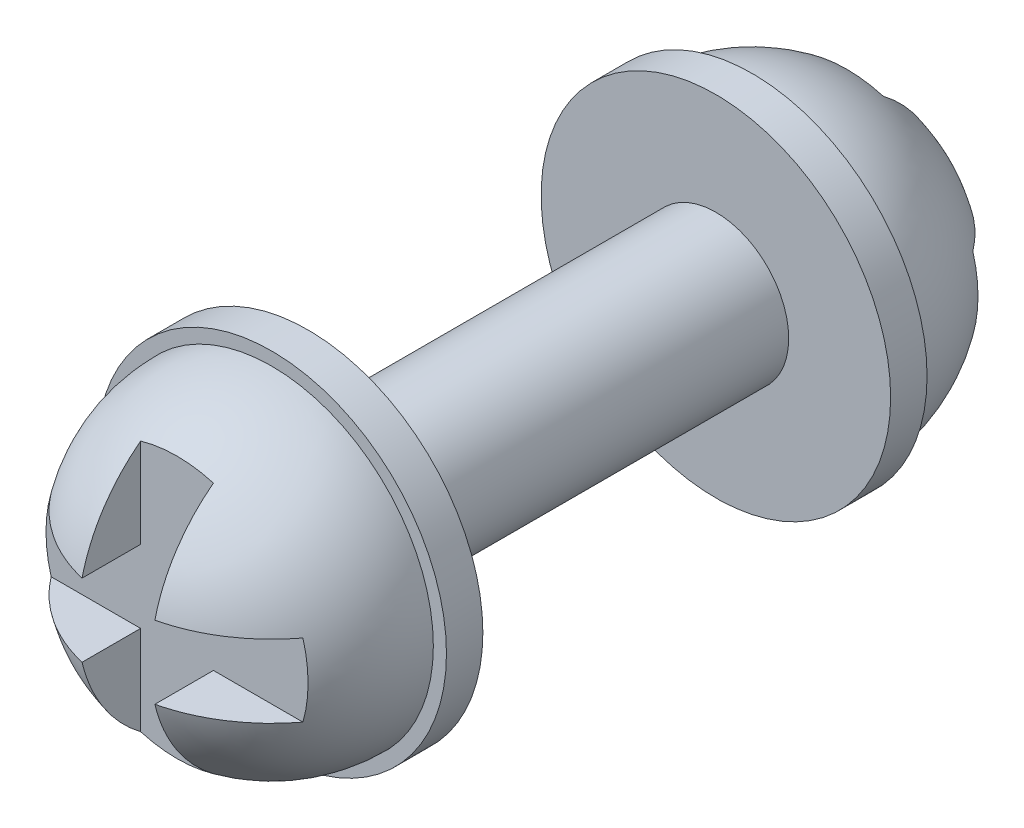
from build123d import *

# Parameters (mm, degrees)
CUT_EXTRUDE1_DEPTH      = 21.574
CUT_EXTRUDE1_DEPTH_BACK = 21.574
SKETCH2_W               = 6.35
SKETCH2_H               = 3.175
CUT_EXTRUDE2_DEPTH      = 21.45229441
CUT_EXTRUDE2_DEPTH_BACK = 21.45229441
SKETCH3_W               = 7.62
SKETCH3_H               = 3.175


with BuildPart() as part:
    # Sketch1 → Revolve1 (revolve)
    with BuildSketch(Plane(origin=(0, 0, 0), x_dir=(0, 0, -1), z_dir=(1, 0, 0)), mode=Mode.PRIVATE) as revolve1_sk:
        with BuildLine():
            Line((-8.89, 3.175), (-8.89, 7.62))
            Line((-8.89, 7.62), (-10.4775, 7.62))
            Line((-10.4775, 7.62), (-10.4775, 7.0485))
            ThreePointArc((-10.4775, 7.0485), (-15.461542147, 4.984042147), (-17.526, 0))
            Line((-17.526, 0), (17.526, 0))
            ThreePointArc((17.526, 0), (15.461542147, 4.984042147), (10.4775, 7.0485))
            Line((10.4775, 7.0485), (10.4775, 7.62))
            Line((10.4775, 7.62), (8.89, 7.62))
            Line((8.89, 7.62), (8.89, 3.175))
            Line((8.89, 3.175), (-8.89, 3.175))
        make_face()
    revolve(revolve1_sk.sketch.rotate(Axis((0, 0, 77.178613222), (0, 0, -1)), 90), axis=Axis((0, 0, 77.178613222), (0, 0, -1)))

    # Sketch2 → Cut-Extrude1 (cut, two sides: drawn at the far end of the back side and taken through both)
    with BuildSketch(Plane(origin=(0, 0, 0), x_dir=(0, 0, -1), z_dir=(1, 0, 0)).offset(-CUT_EXTRUDE1_DEPTH_BACK)):
        with Locations((-17.78, 0)):
            Rectangle(SKETCH2_W, SKETCH2_H)
        with Locations((17.78, 0)):
            Rectangle(SKETCH2_W, SKETCH2_H)
    extrude(amount=CUT_EXTRUDE1_DEPTH + CUT_EXTRUDE1_DEPTH_BACK, mode=Mode.SUBTRACT)

    # Sketch3 → Cut-Extrude2 (cut, two sides: drawn at the far end of the back side and taken through both)
    with BuildSketch(Plane(origin=(0.05268303, 0, -0.014876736), x_dir=(0, 0, -1), z_dir=(0, 1, 0)).offset(-CUT_EXTRUDE2_DEPTH_BACK)):
        with Locations((-18.429876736, 0.05268303)):
            Rectangle(SKETCH3_W, SKETCH3_H)
        with Locations((18.400123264, 0.05268303)):
            Rectangle(SKETCH3_W, SKETCH3_H)
    extrude(amount=CUT_EXTRUDE2_DEPTH + CUT_EXTRUDE2_DEPTH_BACK, mode=Mode.SUBTRACT)


solid = part.part
